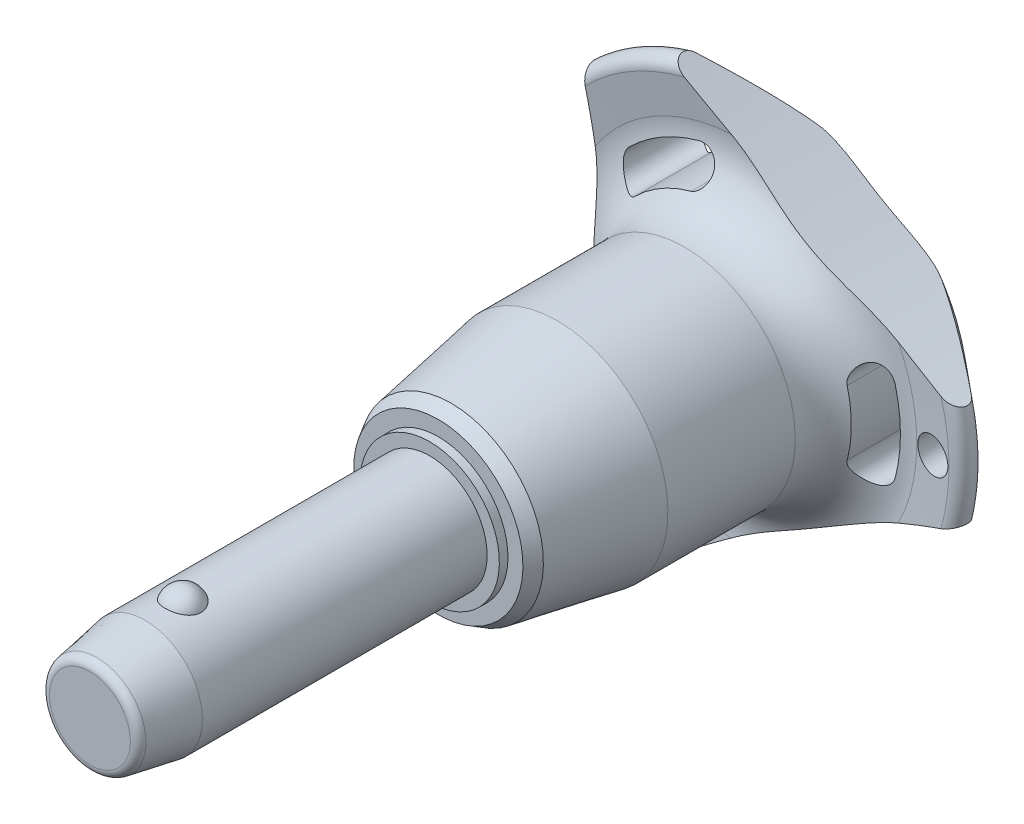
from build123d import *

# Parameters (mm, degrees)
SKETCH1_R           = 5
BOSS_EXTRUDE1_DEPTH = 20
SKETCH2_R           = 4.25
BOSS_EXTRUDE2_DEPTH = 33.3
BOSS_EXTRUDE3_START = 9.6
SKETCH1_2_R         = 5
BOSS_EXTRUDE3_DEPTH = 9.6
CHAMFER1_SIZE       = 4.8
CHAMFER1_SIZE2      = 0.846369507
FILLET1_R           = 0.75
SKETCH6_R           = 102.8
CUT_EXTRUDE1_DEPTH  = 61.079897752
CIRPATTERN1_COUNT   = 3
SKETCH7_R           = 1.5
CUT_EXTRUDE2_DEPTH  = 60.810087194


with BuildPart() as part:
    # Sketch1 → Boss-Extrude1 (new body)
    with BuildSketch(Plane.XY):
        Circle(SKETCH1_R)
    extrude(amount=-BOSS_EXTRUDE1_DEPTH)

    # Sketch2 → Boss-Extrude2 (add)
    with BuildSketch(Plane(origin=(0, 0, -20), x_dir=(-1, 0, 0), z_dir=(0, 0, -1))):
        Circle(SKETCH2_R)
    extrude(amount=BOSS_EXTRUDE2_DEPTH)

    # Sketch3 → Revolve1 (revolve)
    with BuildSketch(Plane(origin=(0, 0, 0), x_dir=(0, 0, -1), z_dir=(1, 0, 0))):
        with BuildLine():
            Line((-1.516575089, 6), (-1.516575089, 2.7))
            ThreePointArc((-1.516575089, 2.7), (0.133424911, 4.35), (-1.516575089, 6))
        make_face()
        with BuildLine():
            Line((-1.516575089, -2.7), (-1.516575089, -6))
            ThreePointArc((-1.516575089, -6), (0.133424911, -4.35), (-1.516575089, -2.7))
        make_face()
    revolve(axis=Axis((0, -2.7, 1.516575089), (0, 1, 0)))

    # Sketch1_2 → Boss-Extrude3 (add)
    with BuildSketch(Plane.XY.offset(BOSS_EXTRUDE3_START)):
        Circle(SKETCH1_2_R)
    extrude(amount=-BOSS_EXTRUDE3_DEPTH)

    # Chamfer1
    chamfer1_edges = [part.edges().sort_by_distance(p)[0] for p in [
        (-5, 0, 9.6),
    ]]
    chamfer1_side = [part.faces().sort_by_distance(p)[0] for p in [
        (-5, 0, -5.2),
    ]]
    chamfer(chamfer1_edges, length=CHAMFER1_SIZE, length2=CHAMFER1_SIZE2, reference=chamfer1_side[0])

    # Fillet1
    fillet1_edges = [part.edges().sort_by_distance(p)[0] for p in [
        (-4.153630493, 0, 9.6),
        (4.25, 0, -53.3),
    ]]
    fillet(fillet1_edges, radius=FILLET1_R)

    # Sketch4 → Revolve2 (revolve)
    with BuildSketch(Plane(origin=(0, 0, 0), x_dir=(0, 0, -1), z_dir=(1, 0, 0))):
        Polygon((20, 0), (20, 6.067402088), (20.75, 6.067402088), (20.75, 7.371950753), (21.879772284, 8.024225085), (31.1, 9.65), (42.2, 9.65), (42.2, 0), align=None)
    revolve(axis=Axis((0, 0, -42.2), (0, 0, 1)))

    # Sketch5 → Revolve3 (revolve)
    with BuildSketch(Plane(origin=(0, 0, 0), x_dir=(0, 0, -1), z_dir=(1, 0, 0)), mode=Mode.PRIVATE) as revolve3_sk:
        with BuildLine():
            Line((47.16082631, 15.274661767), (46.757834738, 18.475067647))
            ThreePointArc((46.757834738, 18.475067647), (47.349836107, 19.516443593), (48.516044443, 19.24278761))
            Line((48.516044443, 19.24278761), (52.835691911, 14.094832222))
            ThreePointArc((52.835691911, 14.094832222), (53.3, 12.689260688), (52.67067517, 11.349423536))
            ThreePointArc((52.67067517, 11.349423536), (49.033110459, 6.185112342), (47.75, 0))
            Line((47.75, 0), (42.2, 0))
            Line((42.2, 0), (42.2, 9.65))
            ThreePointArc((42.2, 9.65), (45.949887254, 11.342683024), (47.16082631, 15.274661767))
        make_face()
    revolve(revolve3_sk.sketch.rotate(Axis((0, 0, -47.75), (0, 0, 1)), 90), axis=Axis((0, 0, -47.75), (0, 0, 1)))

    # Sketch6 → Cut-Extrude1 (cut, through all)
    with BuildSketch(Plane.XY):
        with Locations((-115.2, 0)):
            Circle(SKETCH6_R)
        with BuildLine():
            ThreePointArc((13.411913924, -3.529271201), (13.868496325, 0), (13.411913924, 3.529271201))
            ThreePointArc((13.411913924, 3.529271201), (11.694200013, 4.531299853), (10.692171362, 2.813585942))
            ThreePointArc((10.692171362, 2.813585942), (11.056165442, 0), (10.692171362, -2.813585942))
            ThreePointArc((10.692171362, -2.813585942), (11.694200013, -4.531299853), (13.411913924, -3.529271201))
        make_face()
    cut_extrude1 = extrude(amount=-CUT_EXTRUDE1_DEPTH, mode=Mode.SUBTRACT)

    # CirPattern1: Cut-Extrude1 ×3 about axis
    cirpattern1_axis = Axis((0, 0, 0), (0, 0, 1))
    for i in range(1, CIRPATTERN1_COUNT):
        add(cut_extrude1.rotate(cirpattern1_axis, i * 360 / CIRPATTERN1_COUNT), mode=Mode.SUBTRACT)

    # Sketch7 → Cut-Extrude2 (cut, through all)
    with BuildSketch(Plane.XY):
        with Locations(Location((16.868496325, 0, 0), (0, 0, 225.467095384))):
            Circle(SKETCH7_R)
    extrude(amount=-CUT_EXTRUDE2_DEPTH, mode=Mode.SUBTRACT)


solid = part.part
